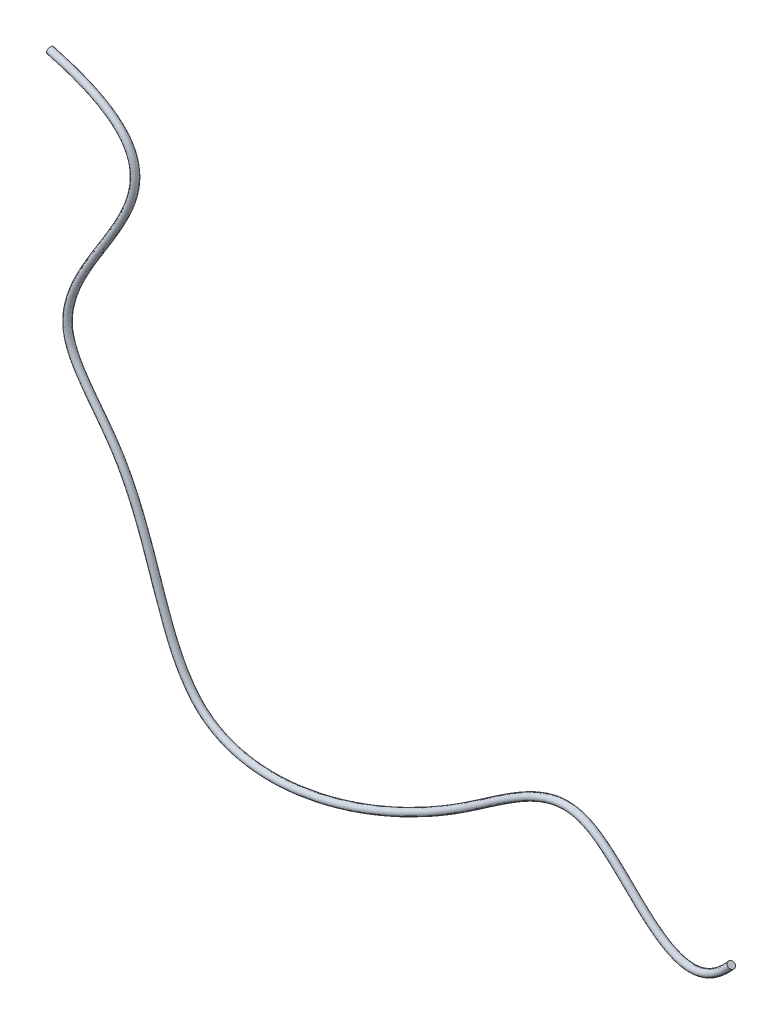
ISO-10303-21;
HEADER;
FILE_DESCRIPTION(('STEP AP214'),'2;1');
FILE_NAME('part.step','',(''),(''),'','','');
FILE_SCHEMA(('AUTOMOTIVE_DESIGN { 1 0 10303 214 1 1 1 1 }'));
ENDSEC;
DATA;
#1=APPLICATION_CONTEXT('core data for automotive mechanical design processes');
#2=APPLICATION_PROTOCOL_DEFINITION('international standard','automotive_design',2000,#1);
#3=PRODUCT_CONTEXT('',#1,'mechanical');
#4=PRODUCT('Part','Part','',(#3));
#5=PRODUCT_RELATED_PRODUCT_CATEGORY('part','',(#4));
#6=PRODUCT_DEFINITION_FORMATION('','',#4);
#7=PRODUCT_DEFINITION_CONTEXT('part definition',#1,'design');
#8=PRODUCT_DEFINITION('design','',#6,#7);
#9=PRODUCT_DEFINITION_SHAPE('','',#8);
#10=(LENGTH_UNIT() NAMED_UNIT(*) SI_UNIT(.MILLI.,.METRE.));
#11=(NAMED_UNIT(*) PLANE_ANGLE_UNIT() SI_UNIT($,.RADIAN.));
#12=(NAMED_UNIT(*) SI_UNIT($,.STERADIAN.) SOLID_ANGLE_UNIT());
#13=UNCERTAINTY_MEASURE_WITH_UNIT(LENGTH_MEASURE(1.E-05),#10,'distance_accuracy_value','');
#14=(GEOMETRIC_REPRESENTATION_CONTEXT(3) GLOBAL_UNCERTAINTY_ASSIGNED_CONTEXT((#13)) GLOBAL_UNIT_ASSIGNED_CONTEXT((#10,
#11,#12)) REPRESENTATION_CONTEXT('',''));
#15=CARTESIAN_POINT('',(0.,0.,0.));
#16=DIRECTION('',(0.,0.,1.));
#17=DIRECTION('',(1.,0.,0.));
#18=AXIS2_PLACEMENT_3D('',#15,#16,#17);
#19=CARTESIAN_POINT('',(0.,663.031643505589,0.));
#20=DIRECTION('',(0.967090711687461,-0.254431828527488,-3.80531743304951E-13));
#21=DIRECTION('',(0.254431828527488,0.967090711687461,0.));
#22=AXIS2_PLACEMENT_3D('',#19,#20,#21);
#23=PLANE('',#22);
#24=CARTESIAN_POINT('',(0.,663.031643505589,0.));
#25=DIRECTION('',(0.967090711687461,-0.254431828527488,-3.80531743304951E-13));
#26=DIRECTION('',(0.254431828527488,0.967090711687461,0.));
#27=AXIS2_PLACEMENT_3D('',#24,#25,#26);
#28=CIRCLE('',#27,5.);
#29=CARTESIAN_POINT('',(1.27215914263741,667.867097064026,0.));
#30=VERTEX_POINT('',#29);
#31=EDGE_CURVE('E43',#30,#30,#28,.T.);
#32=ORIENTED_EDGE('',*,*,#31,.F.);
#33=EDGE_LOOP('',(#32));
#34=FACE_BOUND('',#33,.T.);
#35=ADVANCED_FACE('F37',(#34),#23,.F.);
#36=CARTESIAN_POINT('',(1000.,0.,0.));
#37=DIRECTION('',(0.652907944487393,0.757437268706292,6.94930177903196E-13));
#38=DIRECTION('',(-0.757437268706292,0.652907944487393,3.48567825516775E-13));
#39=AXIS2_PLACEMENT_3D('',#36,#37,#38);
#40=PLANE('',#39);
#41=CARTESIAN_POINT('',(1000.,0.,0.));
#42=DIRECTION('',(0.652907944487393,0.757437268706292,6.94930177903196E-13));
#43=DIRECTION('',(-0.757437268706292,0.652907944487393,3.48567825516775E-13));
#44=AXIS2_PLACEMENT_3D('',#41,#42,#43);
#45=CIRCLE('',#44,5.);
#46=CARTESIAN_POINT('',(996.212813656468,3.26453972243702,1.7428391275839E-12));
#47=VERTEX_POINT('',#46);
#48=EDGE_CURVE('E11',#47,#47,#45,.T.);
#49=ORIENTED_EDGE('',*,*,#48,.T.);
#50=EDGE_LOOP('',(#49));
#51=FACE_BOUND('',#50,.T.);
#52=ADVANCED_FACE('F52',(#51),#40,.T.);
#53=CARTESIAN_POINT('',(1.27215914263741,667.867097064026,0.));
#54=CARTESIAN_POINT('',(35.9701092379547,658.738415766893,-1.36529813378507E-11));
#55=CARTESIAN_POINT('',(62.2858632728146,648.283380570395,-2.43094363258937E-11));
#56=CARTESIAN_POINT('',(91.6965273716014,630.690836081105,-3.67747192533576E-11));
#57=CARTESIAN_POINT('',(99.8232418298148,624.502564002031,-4.03438579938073E-11));
#58=CARTESIAN_POINT('',(113.061953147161,611.469189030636,-4.64451937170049E-11));
#59=CARTESIAN_POINT('',(118.171034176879,604.618135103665,-4.89768173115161E-11));
#60=CARTESIAN_POINT('',(125.620048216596,590.364437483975,-5.30937130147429E-11));
#61=CARTESIAN_POINT('',(127.951714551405,582.968773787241,-5.46753218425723E-11));
#62=CARTESIAN_POINT('',(130.203206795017,567.901427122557,-5.70096823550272E-11));
#63=CARTESIAN_POINT('',(130.129752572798,560.235808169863,-5.77644090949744E-11));
#64=CARTESIAN_POINT('',(127.084596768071,537.05229668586,-5.90727841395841E-11));
#65=CARTESIAN_POINT('',(121.326142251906,521.337025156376,-5.86856565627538E-11));
#66=CARTESIAN_POINT('',(105.978175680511,489.533765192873,-5.67930527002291E-11));
#67=CARTESIAN_POINT('',(96.3644450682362,473.434715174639,-5.52795361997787E-11));
#68=CARTESIAN_POINT('',(76.5204692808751,441.16156594,-5.23691242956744E-11));
#69=CARTESIAN_POINT('',(66.2882433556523,424.989335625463,-5.09713343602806E-11));
#70=CARTESIAN_POINT('',(48.4457706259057,393.085759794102,-4.95175846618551E-11));
#71=CARTESIAN_POINT('',(40.8457504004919,377.353528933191,-4.94654946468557E-11));
#72=CARTESIAN_POINT('',(33.7664898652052,354.620920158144,-5.12723134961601E-11));
#73=CARTESIAN_POINT('',(32.1247808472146,347.191058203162,-5.21876831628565E-11));
#74=CARTESIAN_POINT('',(30.6118782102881,332.702898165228,-5.47706522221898E-11));
#75=CARTESIAN_POINT('',(30.737517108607,325.647693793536,-5.64368121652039E-11));
#76=CARTESIAN_POINT('',(33.4169931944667,309.845429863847,-6.12719403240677E-11));
#77=CARTESIAN_POINT('',(36.7245422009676,301.001764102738,-6.4774988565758E-11));
#78=CARTESIAN_POINT('',(45.9340586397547,283.160334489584,-7.29502711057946E-11));
#79=CARTESIAN_POINT('',(51.8313033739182,274.17801317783,-7.76194339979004E-11));
#80=CARTESIAN_POINT('',(71.5744979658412,246.734470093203,-9.2668933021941E-11));
#81=CARTESIAN_POINT('',(87.4659821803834,227.808388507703,-1.04086371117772E-10));
#82=CARTESIAN_POINT('',(116.095874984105,183.54094334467,-1.27164640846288E-10));
#83=CARTESIAN_POINT('',(127.877236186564,158.133347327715,-1.38523334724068E-10));
#84=CARTESIAN_POINT('',(148.158416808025,106.700506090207,-1.58026969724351E-10));
#85=CARTESIAN_POINT('',(156.659920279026,80.6678346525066,-1.66173170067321E-10));
#86=CARTESIAN_POINT('',(173.713185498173,31.29197647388,-1.77701756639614E-10));
#87=CARTESIAN_POINT('',(182.271135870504,7.95028759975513,-1.81086310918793E-10));
#88=CARTESIAN_POINT('',(197.491090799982,-22.5004276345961,-1.81365283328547E-10));
#89=CARTESIAN_POINT('',(202.958726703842,-31.8889106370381,-1.80657448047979E-10));
#90=CARTESIAN_POINT('',(215.035190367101,-48.7455205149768,-1.77424067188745E-10));
#91=CARTESIAN_POINT('',(221.640644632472,-56.2120196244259,-1.74897130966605E-10));
#92=CARTESIAN_POINT('',(238.370487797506,-70.6395645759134,-1.66855177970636E-10));
#93=CARTESIAN_POINT('',(249.057560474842,-76.9931503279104,-1.60754961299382E-10));
#94=CARTESIAN_POINT('',(272.753526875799,-86.5595233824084,-1.4635050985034E-10));
#95=CARTESIAN_POINT('',(285.763173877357,-89.7661369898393,-1.38046027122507E-10));
#96=CARTESIAN_POINT('',(327.628648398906,-95.0013642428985,-1.11230235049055E-10));
#97=CARTESIAN_POINT('',(359.313918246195,-92.6235708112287,-9.08120891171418E-11));
#98=CARTESIAN_POINT('',(426.219011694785,-78.3535181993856,-5.22100931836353E-11));
#99=CARTESIAN_POINT('',(461.432635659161,-66.4750086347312,-3.4025117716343E-11));
#100=CARTESIAN_POINT('',(531.433997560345,-35.7322467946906,-7.25228688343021E-12));
#101=CARTESIAN_POINT('',(566.224085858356,-16.8702441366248,1.33450430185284E-12));
#102=CARTESIAN_POINT('',(615.482296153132,14.9291795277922,1.4693492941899E-12));
#103=CARTESIAN_POINT('',(631.615745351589,26.2789965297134,-7.10711860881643E-13));
#104=CARTESIAN_POINT('',(663.047014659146,47.7586575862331,-7.99968517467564E-12));
#105=CARTESIAN_POINT('',(678.341996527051,57.8903223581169,-1.31073887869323E-11));
#106=CARTESIAN_POINT('',(708.352089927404,74.45432515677,-2.47756585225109E-11));
#107=CARTESIAN_POINT('',(723.074916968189,80.9041905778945,-3.13375897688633E-11));
#108=CARTESIAN_POINT('',(745.03160240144,85.7619471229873,-4.12216402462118E-11));
#109=CARTESIAN_POINT('',(752.331177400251,86.5720482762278,-4.45244411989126E-11));
#110=CARTESIAN_POINT('',(766.861741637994,86.1756403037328,-5.09463596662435E-11));
#111=CARTESIAN_POINT('',(774.090359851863,84.9641679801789,-5.40650215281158E-11));
#112=CARTESIAN_POINT('',(790.856466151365,79.3482172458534,-6.08983861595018E-11));
#113=CARTESIAN_POINT('',(800.114780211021,74.0601433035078,-6.43549201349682E-11));
#114=CARTESIAN_POINT('',(818.20677072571,61.0945618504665,-7.01065510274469E-11));
#115=CARTESIAN_POINT('',(827.04846764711,53.4027002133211,-7.24058498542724E-11));
#116=CARTESIAN_POINT('',(844.57517607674,37.0894541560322,-7.56231897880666E-11));
#117=CARTESIAN_POINT('',(853.258194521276,28.4656291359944,-7.65406999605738E-11));
#118=CARTESIAN_POINT('',(870.602332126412,11.7646455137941,-7.6723845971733E-11));
#119=CARTESIAN_POINT('',(879.2642039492,3.68838676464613,-7.59896841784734E-11));
#120=CARTESIAN_POINT('',(896.612897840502,-10.4242576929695,-7.25647909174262E-11));
#121=CARTESIAN_POINT('',(905.29941093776,-16.4527132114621,-6.98732673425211E-11));
#122=CARTESIAN_POINT('',(922.619669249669,-25.0655695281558,-6.21903453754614E-11));
#123=CARTESIAN_POINT('',(931.217080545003,-27.6491203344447,-5.71853943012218E-11));
#124=CARTESIAN_POINT('',(944.210488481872,-28.1770197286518,-4.77926544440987E-11));
#125=CARTESIAN_POINT('',(948.568037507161,-27.7987865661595,-4.43516222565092E-11));
#126=CARTESIAN_POINT('',(957.457594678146,-25.7527965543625,-3.6854659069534E-11));
#127=CARTESIAN_POINT('',(961.992869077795,-24.0831006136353,-3.27997742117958E-11));
#128=CARTESIAN_POINT('',(975.989673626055,-16.7569165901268,-1.96915650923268E-11));
#129=CARTESIAN_POINT('',(985.851366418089,-8.75575557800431,-9.69573669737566E-12));
#130=CARTESIAN_POINT('',(996.212813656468,3.26453972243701,1.7428391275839E-12));
#131=CARTESIAN_POINT('',(1.27215914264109,667.867097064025,10.));
#132=CARTESIAN_POINT('',(35.9701092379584,658.738415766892,9.99999999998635));
#133=CARTESIAN_POINT('',(62.2858632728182,648.28338057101,9.99999999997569));
#134=CARTESIAN_POINT('',(91.696527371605,630.690836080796,9.99999999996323));
#135=CARTESIAN_POINT('',(99.8232418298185,624.502564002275,9.99999999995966));
#136=CARTESIAN_POINT('',(113.061953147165,611.46918903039,9.99999999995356));
#137=CARTESIAN_POINT('',(118.171034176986,604.618135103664,9.99999999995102));
#138=CARTESIAN_POINT('',(125.620048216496,590.364437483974,9.9999999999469));
#139=CARTESIAN_POINT('',(127.951714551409,582.96877378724,9.99999999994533));
#140=CARTESIAN_POINT('',(130.20320679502,567.901427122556,9.99999999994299));
#141=CARTESIAN_POINT('',(130.129752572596,560.235808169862,9.99999999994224));
#142=CARTESIAN_POINT('',(127.084596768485,537.052296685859,9.99999999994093));
#143=CARTESIAN_POINT('',(121.326142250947,521.337025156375,9.99999999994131));
#144=CARTESIAN_POINT('',(105.978175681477,489.533765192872,9.99999999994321));
#145=CARTESIAN_POINT('',(96.364445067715,473.434715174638,9.99999999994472));
#146=CARTESIAN_POINT('',(76.520469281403,441.161565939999,9.99999999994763));
#147=CARTESIAN_POINT('',(66.2882433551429,424.989335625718,9.99999999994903));
#148=CARTESIAN_POINT('',(48.4457706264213,393.085759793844,9.99999999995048));
#149=CARTESIAN_POINT('',(40.8457504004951,377.353528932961,9.99999999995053));
#150=CARTESIAN_POINT('',(33.7664898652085,354.620920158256,9.99999999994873));
#151=CARTESIAN_POINT('',(32.124780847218,347.19105820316,9.99999999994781));
#152=CARTESIAN_POINT('',(30.6118782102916,332.702898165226,9.99999999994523));
#153=CARTESIAN_POINT('',(30.7375171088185,325.647693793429,9.99999999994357));
#154=CARTESIAN_POINT('',(33.4169931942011,309.845429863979,9.99999999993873));
#155=CARTESIAN_POINT('',(36.7245422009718,301.001764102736,9.99999999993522));
#156=CARTESIAN_POINT('',(45.934058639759,283.160334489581,9.99999999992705));
#157=CARTESIAN_POINT('',(51.8313033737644,274.178013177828,9.99999999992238));
#158=CARTESIAN_POINT('',(71.5744979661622,246.7344700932,9.99999999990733));
#159=CARTESIAN_POINT('',(87.4659821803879,227.808388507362,9.99999999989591));
#160=CARTESIAN_POINT('',(116.09587498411,183.540943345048,9.99999999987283));
#161=CARTESIAN_POINT('',(127.877236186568,158.133347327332,9.99999999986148));
#162=CARTESIAN_POINT('',(148.15841680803,106.700506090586,9.99999999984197));
#163=CARTESIAN_POINT('',(156.659920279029,80.6678346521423,9.99999999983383));
#164=CARTESIAN_POINT('',(173.713185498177,31.2919764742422,9.9999999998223));
#165=CARTESIAN_POINT('',(182.271135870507,7.95028759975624,9.99999999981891));
#166=CARTESIAN_POINT('',(197.491090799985,-22.500427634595,9.99999999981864));
#167=CARTESIAN_POINT('',(202.958726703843,-31.8889106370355,9.99999999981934));
#168=CARTESIAN_POINT('',(215.035190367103,-48.7455205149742,9.99999999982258));
#169=CARTESIAN_POINT('',(221.64064463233,-56.2120196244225,9.9999999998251));
#170=CARTESIAN_POINT('',(238.370487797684,-70.6395645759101,9.99999999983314));
#171=CARTESIAN_POINT('',(249.057560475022,-76.9931503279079,9.99999999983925));
#172=CARTESIAN_POINT('',(272.75352687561,-86.5595233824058,9.99999999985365));
#173=CARTESIAN_POINT('',(285.763173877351,-89.7661369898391,9.99999999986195));
#174=CARTESIAN_POINT('',(327.6286483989,-95.0013642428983,9.99999999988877));
#175=CARTESIAN_POINT('',(359.31391824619,-92.6235708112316,9.99999999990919));
#176=CARTESIAN_POINT('',(426.21901169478,-78.3535181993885,9.99999999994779));
#177=CARTESIAN_POINT('',(461.432635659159,-66.4750086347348,9.99999999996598));
#178=CARTESIAN_POINT('',(531.433997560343,-35.7322467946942,9.99999999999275));
#179=CARTESIAN_POINT('',(566.224085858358,-16.8702441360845,10.0000000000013));
#180=CARTESIAN_POINT('',(615.482296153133,14.9291795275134,10.0000000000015));
#181=CARTESIAN_POINT('',(631.615745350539,26.278996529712,9.99999999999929));
#182=CARTESIAN_POINT('',(663.047014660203,47.7586575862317,9.999999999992));
#183=CARTESIAN_POINT('',(678.341996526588,57.8903223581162,9.99999999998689));
#184=CARTESIAN_POINT('',(708.352089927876,74.4543251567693,9.99999999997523));
#185=CARTESIAN_POINT('',(723.074916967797,80.9041905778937,9.99999999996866));
#186=CARTESIAN_POINT('',(745.031602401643,85.7619471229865,9.99999999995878));
#187=CARTESIAN_POINT('',(752.331177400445,86.5720482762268,9.99999999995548));
#188=CARTESIAN_POINT('',(766.86174163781,86.1756403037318,9.99999999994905));
#189=CARTESIAN_POINT('',(774.090359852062,84.9641679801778,9.99999999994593));
#190=CARTESIAN_POINT('',(790.856466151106,79.3482172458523,9.9999999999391));
#191=CARTESIAN_POINT('',(800.114780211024,74.0601433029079,9.99999999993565));
#192=CARTESIAN_POINT('',(818.206770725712,61.0945618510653,9.99999999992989));
#193=CARTESIAN_POINT('',(827.048467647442,53.4027002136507,9.99999999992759));
#194=CARTESIAN_POINT('',(844.575176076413,37.0894541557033,9.99999999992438));
#195=CARTESIAN_POINT('',(853.258194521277,28.4656291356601,9.99999999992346));
#196=CARTESIAN_POINT('',(870.602332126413,11.764645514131,9.99999999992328));
#197=CARTESIAN_POINT('',(879.264203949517,3.6883867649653,9.99999999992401));
#198=CARTESIAN_POINT('',(896.612897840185,-10.4242576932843,9.99999999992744));
#199=CARTESIAN_POINT('',(905.299410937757,-16.4527132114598,9.99999999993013));
#200=CARTESIAN_POINT('',(922.619669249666,-25.0655695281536,9.99999999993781));
#201=CARTESIAN_POINT('',(931.217080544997,-27.6491203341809,9.99999999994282));
#202=CARTESIAN_POINT('',(944.210488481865,-28.1770197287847,9.99999999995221));
#203=CARTESIAN_POINT('',(948.568037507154,-27.7987865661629,9.99999999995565));
#204=CARTESIAN_POINT('',(957.45759467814,-25.7527965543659,9.99999999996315));
#205=CARTESIAN_POINT('',(961.99286907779,-24.0831006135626,9.9999999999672));
#206=CARTESIAN_POINT('',(975.98967362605,-16.7569165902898,9.99999999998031));
#207=CARTESIAN_POINT('',(985.851366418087,-8.75575557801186,9.9999999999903));
#208=CARTESIAN_POINT('',(996.212813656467,3.26453972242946,10.0000000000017));
#209=CARTESIAN_POINT('',(-1.27215914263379,658.196189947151,10.));
#210=CARTESIAN_POINT('',(32.8087585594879,649.229843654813,9.99999999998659));
#211=CARTESIAN_POINT('',(58.2945709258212,639.018354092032,9.99999999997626));
#212=CARTESIAN_POINT('',(85.9920761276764,622.450567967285,9.99999999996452));
#213=CARTESIAN_POINT('',(93.4690547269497,616.725305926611,9.99999999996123));
#214=CARTESIAN_POINT('',(105.384964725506,604.994215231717,9.99999999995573));
#215=CARTESIAN_POINT('',(109.826811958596,598.994337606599,9.99999999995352));
#216=CARTESIAN_POINT('',(116.238851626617,586.724891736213,9.99999999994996));
#217=CARTESIAN_POINT('',(118.217310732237,580.44834349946,9.9999999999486));
#218=CARTESIAN_POINT('',(120.157228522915,567.466102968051,9.99999999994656));
#219=CARTESIAN_POINT('',(120.11196733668,560.754346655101,9.99999999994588));
#220=CARTESIAN_POINT('',(117.375658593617,539.922162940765,9.99999999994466));
#221=CARTESIAN_POINT('',(112.046045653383,525.11554511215,9.99999999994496));
#222=CARTESIAN_POINT('',(97.2460575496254,494.447777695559,9.99999999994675));
#223=CARTESIAN_POINT('',(87.7999009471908,478.597689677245,9.99999999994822));
#224=CARTESIAN_POINT('',(68.047978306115,446.474250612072,9.99999999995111));
#225=CARTESIAN_POINT('',(57.7441930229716,430.199030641,9.99999999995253));
#226=CARTESIAN_POINT('',(39.5342150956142,397.638330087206,9.99999999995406));
#227=CARTESIAN_POINT('',(31.617795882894,381.353734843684,9.99999999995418));
#228=CARTESIAN_POINT('',(24.0588478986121,357.080774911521,9.99999999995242));
#229=CARTESIAN_POINT('',(22.2605625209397,349.012059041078,9.99999999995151));
#230=CARTESIAN_POINT('',(20.5842552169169,332.959070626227,9.99999999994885));
#231=CARTESIAN_POINT('',(20.7094007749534,324.971704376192,9.99999999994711));
#232=CARTESIAN_POINT('',(23.7766698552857,306.882423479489,9.99999999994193));
#233=CARTESIAN_POINT('',(27.4993424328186,297.07206027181,9.99999999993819));
#234=CARTESIAN_POINT('',(37.3872661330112,277.916364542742,9.99999999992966));
#235=CARTESIAN_POINT('',(43.5572399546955,268.555589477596,9.99999999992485));
#236=CARTESIAN_POINT('',(63.7697980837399,240.459619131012,9.99999999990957));
#237=CARTESIAN_POINT('',(79.5209450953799,221.679059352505,9.99999999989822));
#238=CARTESIAN_POINT('',(107.191257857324,178.89531366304,9.99999999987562));
#239=CARTESIAN_POINT('',(118.719944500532,154.095837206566,9.99999999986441));
#240=CARTESIAN_POINT('',(138.709979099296,103.401338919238,9.99999999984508));
#241=CARTESIAN_POINT('',(147.169642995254,77.5137433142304,9.99999999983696));
#242=CARTESIAN_POINT('',(164.299203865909,27.9169794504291,9.99999999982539));
#243=CARTESIAN_POINT('',(172.962912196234,4.20631333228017,9.99999999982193));
#244=CARTESIAN_POINT('',(188.727842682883,-27.334739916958,9.99999999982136));
#245=CARTESIAN_POINT('',(194.447234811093,-37.1790524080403,9.99999999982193));
#246=CARTESIAN_POINT('',(207.288464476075,-55.1031405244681,9.99999999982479));
#247=CARTESIAN_POINT('',(214.413675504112,-63.1845439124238,9.99999999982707));
#248=CARTESIAN_POINT('',(232.726115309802,-78.9768944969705,9.99999999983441));
#249=CARTESIAN_POINT('',(244.396941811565,-85.8957723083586,9.9999999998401));
#250=CARTESIAN_POINT('',(269.927005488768,-96.2025945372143,9.99999999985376));
#251=CARTESIAN_POINT('',(283.785489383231,-99.5967126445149,9.99999999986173));
#252=CARTESIAN_POINT('',(327.861545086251,-105.108370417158,9.9999999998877));
#253=CARTESIAN_POINT('',(360.58681209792,-102.577007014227,9.99999999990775));
#254=CARTESIAN_POINT('',(429.118038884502,-87.960119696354,9.99999999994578));
#255=CARTESIAN_POINT('',(464.930198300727,-75.8608461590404,9.99999999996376));
#256=CARTESIAN_POINT('',(535.978529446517,-44.6582828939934,9.99999999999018));
#257=CARTESIAN_POINT('',(571.212350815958,-25.5527435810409,9.99999999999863));
#258=CARTESIAN_POINT('',(621.12765523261,6.67087768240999,9.99999999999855));
#259=CARTESIAN_POINT('',(637.336100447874,18.0761617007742,9.99999999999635));
#260=CARTESIAN_POINT('',(668.611052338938,39.4489977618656,9.99999999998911));
#261=CARTESIAN_POINT('',(683.680397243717,49.4147290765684,9.99999999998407));
#262=CARTESIAN_POINT('',(712.678237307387,65.4200209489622,9.99999999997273));
#263=CARTESIAN_POINT('',(726.599016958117,71.4420541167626,9.99999999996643));
#264=CARTESIAN_POINT('',(746.509837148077,75.8471778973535,9.99999999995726));
#265=CARTESIAN_POINT('',(752.983113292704,76.5505422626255,9.99999999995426));
#266=CARTESIAN_POINT('',(765.66438915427,76.2045846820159,9.99999999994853));
#267=CARTESIAN_POINT('',(771.874759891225,75.1602259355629,9.9999999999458));
#268=CARTESIAN_POINT('',(786.380360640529,70.3014508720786,9.99999999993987));
#269=CARTESIAN_POINT('',(794.829296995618,65.5451928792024,9.99999999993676));
#270=CARTESIAN_POINT('',(811.842079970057,53.353022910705,9.99999999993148));
#271=CARTESIAN_POINT('',(820.397906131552,45.9314650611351,9.9999999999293));
#272=CARTESIAN_POINT('',(837.599480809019,29.9208421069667,9.99999999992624));
#273=CARTESIAN_POINT('',(846.247222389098,21.3342176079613,9.99999999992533));
#274=CARTESIAN_POINT('',(863.740806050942,4.48932967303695,9.99999999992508));
#275=CARTESIAN_POINT('',(872.585895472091,-3.76983361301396,9.99999999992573));
#276=CARTESIAN_POINT('',(890.670289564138,-18.4809482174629,9.99999999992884));
#277=CARTESIAN_POINT('',(899.909903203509,-24.9408297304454,9.99999999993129));
#278=CARTESIAN_POINT('',(919.104028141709,-34.4855049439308,9.99999999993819));
#279=CARTESIAN_POINT('',(929.094873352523,-37.5711486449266,9.99999999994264));
#280=CARTESIAN_POINT('',(944.662670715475,-38.2036409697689,9.99999999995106));
#281=CARTESIAN_POINT('',(949.938660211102,-37.7447713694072,9.99999999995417));
#282=CARTESIAN_POINT('',(960.572824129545,-35.2972486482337,9.99999999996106));
#283=CARTESIAN_POINT('',(965.927732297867,-33.3105346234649,9.99999999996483));
#284=CARTESIAN_POINT('',(982.03199732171,-24.8812671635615,9.99999999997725));
#285=CARTESIAN_POINT('',(992.811713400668,-15.9971650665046,9.99999999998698));
#286=CARTESIAN_POINT('',(1003.78718634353,-3.26453972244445,9.99999999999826));
#287=CARTESIAN_POINT('',(-1.27215914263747,658.196189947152,0.));
#288=CARTESIAN_POINT('',(32.8087585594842,649.229843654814,-1.34095785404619E-11));
#289=CARTESIAN_POINT('',(58.2945709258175,639.018354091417,-2.37373147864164E-11));
#290=CARTESIAN_POINT('',(85.9920761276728,622.450567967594,-3.54794616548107E-11));
#291=CARTESIAN_POINT('',(93.4690547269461,616.725305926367,-3.8767990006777E-11));
#292=CARTESIAN_POINT('',(105.384964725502,604.994215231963,-4.42673051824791E-11));
#293=CARTESIAN_POINT('',(109.826811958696,598.9943376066,-4.6478665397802E-11));
#294=CARTESIAN_POINT('',(116.23885162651,586.724891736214,-5.00413231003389E-11));
#295=CARTESIAN_POINT('',(118.217310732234,580.448343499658,-5.13962838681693E-11));
#296=CARTESIAN_POINT('',(120.157228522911,567.466102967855,-5.34369174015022E-11));
#297=CARTESIAN_POINT('',(120.111967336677,560.754346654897,-5.41206151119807E-11));
#298=CARTESIAN_POINT('',(117.375658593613,539.922162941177,-5.53426993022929E-11));
#299=CARTESIAN_POINT('',(112.04604565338,525.115545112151,-5.50370475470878E-11));
#300=CARTESIAN_POINT('',(97.246057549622,494.44777769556,-5.32507409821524E-11));
#301=CARTESIAN_POINT('',(87.7999009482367,478.597689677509,-5.1778126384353E-11));
#302=CARTESIAN_POINT('',(68.0479783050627,446.474250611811,-4.88890768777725E-11));
#303=CARTESIAN_POINT('',(57.7441930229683,430.199030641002,-4.74735364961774E-11));
#304=CARTESIAN_POINT('',(39.5342150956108,397.638330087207,-4.59395788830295E-11));
#305=CARTESIAN_POINT('',(31.6177958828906,381.353734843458,-4.58172919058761E-11));
#306=CARTESIAN_POINT('',(24.0588478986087,357.080774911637,-4.75777369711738E-11));
#307=CARTESIAN_POINT('',(22.2605625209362,349.012059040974,-4.84895935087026E-11));
#308=CARTESIAN_POINT('',(20.5842552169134,332.959070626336,-5.11456223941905E-11));
#309=CARTESIAN_POINT('',(20.7094007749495,324.971704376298,-5.28912341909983E-11));
#310=CARTESIAN_POINT('',(23.7766698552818,306.882423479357,-5.80656161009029E-11));
#311=CARTESIAN_POINT('',(27.4993424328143,297.072060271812,-6.18052625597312E-11));
#312=CARTESIAN_POINT('',(37.3872661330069,277.916364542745,-7.03445158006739E-11));
#313=CARTESIAN_POINT('',(43.5572399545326,268.555589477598,-7.51471939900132E-11));
#314=CARTESIAN_POINT('',(63.7697980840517,240.459619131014,-9.04265663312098E-11));
#315=CARTESIAN_POINT('',(79.5209450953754,221.679059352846,-1.01779506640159E-10));
#316=CARTESIAN_POINT('',(107.19125785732,178.895313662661,-1.24375014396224E-10));
#317=CARTESIAN_POINT('',(118.719944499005,154.095837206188,-1.3558801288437E-10));
#318=CARTESIAN_POINT('',(138.709979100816,103.401338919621,-1.54920554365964E-10));
#319=CARTESIAN_POINT('',(147.169642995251,77.5137433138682,-1.6303883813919E-10));
#320=CARTESIAN_POINT('',(164.299203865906,27.9169794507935,-1.74614602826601E-10));
#321=CARTESIAN_POINT('',(172.962912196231,4.20631333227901,-1.78069915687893E-10));
#322=CARTESIAN_POINT('',(188.727842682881,-27.3347399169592,-1.78644224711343E-10));
#323=CARTESIAN_POINT('',(194.447234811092,-37.1790524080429,-1.78068733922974E-10));
#324=CARTESIAN_POINT('',(207.288464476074,-55.1031405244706,-1.75210280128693E-10));
#325=CARTESIAN_POINT('',(214.413675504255,-63.1845439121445,-1.72928707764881E-10));
#326=CARTESIAN_POINT('',(232.726115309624,-78.9768944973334,-1.65590501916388E-10));
#327=CARTESIAN_POINT('',(244.396941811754,-85.8957723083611,-1.59903555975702E-10));
#328=CARTESIAN_POINT('',(269.927005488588,-96.2025945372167,-1.46242820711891E-10));
#329=CARTESIAN_POINT('',(283.785489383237,-99.5967126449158,-1.38269279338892E-10));
#330=CARTESIAN_POINT('',(327.861545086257,-105.108370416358,-1.12297239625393E-10));
#331=CARTESIAN_POINT('',(360.586812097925,-102.577007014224,-9.22518183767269E-11));
#332=CARTESIAN_POINT('',(429.118038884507,-87.9601196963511,-5.42234959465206E-11));
#333=CARTESIAN_POINT('',(464.93019829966,-75.8608461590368,-3.6241720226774E-11));
#334=CARTESIAN_POINT('',(535.978529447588,-44.6582828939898,-9.8180393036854E-12));
#335=CARTESIAN_POINT('',(571.212350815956,-25.5527435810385,-1.3750699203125E-12));
#336=CARTESIAN_POINT('',(621.127655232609,6.67087768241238,-1.44777084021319E-12));
#337=CARTESIAN_POINT('',(637.33610044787,18.0761617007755,-3.65091733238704E-12));
#338=CARTESIAN_POINT('',(668.611052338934,39.4489977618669,-1.08910221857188E-11));
#339=CARTESIAN_POINT('',(683.680397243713,49.4147290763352,-1.59291890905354E-11));
#340=CARTESIAN_POINT('',(712.678237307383,65.4200209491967,-2.7269638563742E-11));
#341=CARTESIAN_POINT('',(726.599016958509,71.4420541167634,-3.35705560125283E-11));
#342=CARTESIAN_POINT('',(746.509837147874,75.8471778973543,-4.27342486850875E-11));
#343=CARTESIAN_POINT('',(752.983113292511,76.5505422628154,-4.57396071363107E-11));
#344=CARTESIAN_POINT('',(765.664389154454,76.204584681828,-5.14711202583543E-11));
#345=CARTESIAN_POINT('',(771.874759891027,75.1602259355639,-5.41977305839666E-11));
#346=CARTESIAN_POINT('',(786.380360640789,70.3014508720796,-6.01277504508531E-11));
#347=CARTESIAN_POINT('',(794.829296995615,65.5451928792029,-6.32385679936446E-11));
#348=CARTESIAN_POINT('',(811.842079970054,53.3530229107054,-6.85237346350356E-11));
#349=CARTESIAN_POINT('',(820.39790613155,45.9314650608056,-7.06938818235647E-11));
#350=CARTESIAN_POINT('',(837.599480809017,29.9208421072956,-7.37647423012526E-11));
#351=CARTESIAN_POINT('',(846.247222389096,21.3342176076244,-7.4665986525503E-11));
#352=CARTESIAN_POINT('',(863.740806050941,4.4893296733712,-7.49168715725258E-11));
#353=CARTESIAN_POINT('',(872.585895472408,-3.76983361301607,-7.42663100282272E-11));
#354=CARTESIAN_POINT('',(890.670289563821,-18.4809482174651,-7.11654927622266E-11));
#355=CARTESIAN_POINT('',(899.909903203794,-24.9408297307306,-6.8716029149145E-11));
#356=CARTESIAN_POINT('',(919.104028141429,-34.48550494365,-6.18079267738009E-11));
#357=CARTESIAN_POINT('',(929.094873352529,-37.5711486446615,-5.73628406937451E-11));
#358=CARTESIAN_POINT('',(944.662670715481,-38.2036409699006,-4.89341477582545E-11));
#359=CARTESIAN_POINT('',(949.938660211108,-37.7447713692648,-4.58269728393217E-11));
#360=CARTESIAN_POINT('',(960.572824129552,-35.2972486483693,-3.89429645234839E-11));
#361=CARTESIAN_POINT('',(965.927732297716,-33.3105346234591,-3.51650849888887E-11));
#362=CARTESIAN_POINT('',(982.03199732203,-24.8812671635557,-2.27445176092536E-11));
#363=CARTESIAN_POINT('',(992.811713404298,-15.9971650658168,-1.30138505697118E-11));
#364=CARTESIAN_POINT('',(1003.78718634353,-3.2645397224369,-1.74222680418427E-12));
#365=CARTESIAN_POINT('',(-1.27215914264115,658.196189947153,-10.));
#366=CARTESIAN_POINT('',(32.8087585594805,649.229843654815,-10.0000000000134));
#367=CARTESIAN_POINT('',(58.2945709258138,639.018354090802,-10.0000000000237));
#368=CARTESIAN_POINT('',(85.9920761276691,622.450567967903,-10.0000000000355));
#369=CARTESIAN_POINT('',(93.4690547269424,616.725305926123,-10.0000000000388));
#370=CARTESIAN_POINT('',(105.384964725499,604.994215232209,-10.0000000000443));
#371=CARTESIAN_POINT('',(109.826811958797,598.994337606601,-10.0000000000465));
#372=CARTESIAN_POINT('',(116.238851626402,586.724891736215,-10.00000000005));
#373=CARTESIAN_POINT('',(118.21731073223,580.448343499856,-10.0000000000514));
#374=CARTESIAN_POINT('',(120.157228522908,567.46610296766,-10.0000000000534));
#375=CARTESIAN_POINT('',(120.111967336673,560.754346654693,-10.0000000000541));
#376=CARTESIAN_POINT('',(117.37565859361,539.922162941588,-10.0000000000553));
#377=CARTESIAN_POINT('',(112.046045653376,525.115545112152,-10.000000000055));
#378=CARTESIAN_POINT('',(97.2460575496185,494.447777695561,-10.0000000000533));
#379=CARTESIAN_POINT('',(87.7999009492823,478.597689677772,-10.0000000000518));
#380=CARTESIAN_POINT('',(68.0479783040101,446.47425061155,-10.0000000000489));
#381=CARTESIAN_POINT('',(57.7441930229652,430.199030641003,-10.0000000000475));
#382=CARTESIAN_POINT('',(39.5342150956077,397.638330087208,-10.0000000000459));
#383=CARTESIAN_POINT('',(31.6177958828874,381.353734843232,-10.0000000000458));
#384=CARTESIAN_POINT('',(24.0588478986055,357.080774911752,-10.0000000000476));
#385=CARTESIAN_POINT('',(22.2605625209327,349.012059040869,-10.0000000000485));
#386=CARTESIAN_POINT('',(20.5842552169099,332.959070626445,-10.0000000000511));
#387=CARTESIAN_POINT('',(20.7094007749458,324.971704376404,-10.0000000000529));
#388=CARTESIAN_POINT('',(23.776669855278,306.882423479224,-10.0000000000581));
#389=CARTESIAN_POINT('',(27.4993424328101,297.072060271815,-10.0000000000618));
#390=CARTESIAN_POINT('',(37.3872661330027,277.916364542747,-10.0000000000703));
#391=CARTESIAN_POINT('',(43.5572399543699,268.5555894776,-10.0000000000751));
#392=CARTESIAN_POINT('',(63.7697980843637,240.459619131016,-10.0000000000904));
#393=CARTESIAN_POINT('',(79.5209450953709,221.679059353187,-10.0000000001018));
#394=CARTESIAN_POINT('',(107.191257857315,178.895313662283,-10.0000000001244));
#395=CARTESIAN_POINT('',(118.719944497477,154.095837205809,-10.0000000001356));
#396=CARTESIAN_POINT('',(138.709979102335,103.401338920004,-10.0000000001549));
#397=CARTESIAN_POINT('',(147.169642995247,77.513743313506,-10.000000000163));
#398=CARTESIAN_POINT('',(164.299203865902,27.9169794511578,-10.0000000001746));
#399=CARTESIAN_POINT('',(172.962912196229,4.2063133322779,-10.0000000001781));
#400=CARTESIAN_POINT('',(188.727842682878,-27.3347399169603,-10.0000000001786));
#401=CARTESIAN_POINT('',(194.447234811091,-37.1790524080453,-10.0000000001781));
#402=CARTESIAN_POINT('',(207.288464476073,-55.1031405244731,-10.0000000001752));
#403=CARTESIAN_POINT('',(214.413675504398,-63.1845439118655,-10.0000000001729));
#404=CARTESIAN_POINT('',(232.726115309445,-78.9768944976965,-10.0000000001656));
#405=CARTESIAN_POINT('',(244.396941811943,-85.8957723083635,-10.0000000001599));
#406=CARTESIAN_POINT('',(269.927005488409,-96.2025945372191,-10.0000000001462));
#407=CARTESIAN_POINT('',(283.785489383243,-99.5967126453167,-10.0000000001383));
#408=CARTESIAN_POINT('',(327.861545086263,-105.108370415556,-10.0000000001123));
#409=CARTESIAN_POINT('',(360.58681209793,-102.577007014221,-10.0000000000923));
#410=CARTESIAN_POINT('',(429.118038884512,-87.9601196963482,-10.0000000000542));
#411=CARTESIAN_POINT('',(464.930198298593,-75.8608461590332,-10.0000000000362));
#412=CARTESIAN_POINT('',(535.978529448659,-44.6582828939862,-10.0000000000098));
#413=CARTESIAN_POINT('',(571.212350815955,-25.5527435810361,-10.0000000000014));
#414=CARTESIAN_POINT('',(621.127655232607,6.67087768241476,-10.0000000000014));
#415=CARTESIAN_POINT('',(637.336100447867,18.0761617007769,-10.0000000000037));
#416=CARTESIAN_POINT('',(668.611052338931,39.4489977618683,-10.0000000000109));
#417=CARTESIAN_POINT('',(683.680397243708,49.414729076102,-10.0000000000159));
#418=CARTESIAN_POINT('',(712.678237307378,65.4200209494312,-10.0000000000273));
#419=CARTESIAN_POINT('',(726.599016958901,71.4420541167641,-10.0000000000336));
#420=CARTESIAN_POINT('',(746.509837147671,75.847177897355,-10.0000000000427));
#421=CARTESIAN_POINT('',(752.983113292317,76.5505422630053,-10.0000000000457));
#422=CARTESIAN_POINT('',(765.664389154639,76.2045846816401,-10.0000000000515));
#423=CARTESIAN_POINT('',(771.874759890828,75.160225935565,-10.0000000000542));
#424=CARTESIAN_POINT('',(786.380360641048,70.3014508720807,-10.0000000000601));
#425=CARTESIAN_POINT('',(794.829296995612,65.5451928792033,-10.0000000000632));
#426=CARTESIAN_POINT('',(811.842079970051,53.3530229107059,-10.0000000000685));
#427=CARTESIAN_POINT('',(820.397906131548,45.931465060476,-10.0000000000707));
#428=CARTESIAN_POINT('',(837.599480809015,29.9208421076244,-10.0000000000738));
#429=CARTESIAN_POINT('',(846.247222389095,21.3342176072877,-10.0000000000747));
#430=CARTESIAN_POINT('',(863.740806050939,4.48932967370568,-10.0000000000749));
#431=CARTESIAN_POINT('',(872.585895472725,-3.76983361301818,-10.0000000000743));
#432=CARTESIAN_POINT('',(890.670289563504,-18.4809482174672,-10.0000000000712));
#433=CARTESIAN_POINT('',(899.90990320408,-24.9408297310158,-10.0000000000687));
#434=CARTESIAN_POINT('',(919.104028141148,-34.4855049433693,-10.0000000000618));
#435=CARTESIAN_POINT('',(929.094873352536,-37.5711486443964,-10.0000000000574));
#436=CARTESIAN_POINT('',(944.662670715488,-38.2036409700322,-10.0000000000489));
#437=CARTESIAN_POINT('',(949.938660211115,-37.7447713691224,-10.0000000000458));
#438=CARTESIAN_POINT('',(960.572824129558,-35.297248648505,-10.0000000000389));
#439=CARTESIAN_POINT('',(965.927732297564,-33.3105346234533,-10.0000000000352));
#440=CARTESIAN_POINT('',(982.03199732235,-24.8812671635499,-10.0000000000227));
#441=CARTESIAN_POINT('',(992.811713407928,-15.9971650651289,-10.000000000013));
#442=CARTESIAN_POINT('',(1003.78718634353,-3.26453972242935,-10.0000000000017));
#443=CARTESIAN_POINT('',(1.27215914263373,667.867097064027,-10.));
#444=CARTESIAN_POINT('',(35.970109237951,658.738415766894,-10.0000000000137));
#445=CARTESIAN_POINT('',(62.2858632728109,648.28338056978,-10.0000000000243));
#446=CARTESIAN_POINT('',(91.6965273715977,630.690836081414,-10.0000000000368));
#447=CARTESIAN_POINT('',(99.8232418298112,624.502564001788,-10.0000000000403));
#448=CARTESIAN_POINT('',(113.061953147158,611.469189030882,-10.0000000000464));
#449=CARTESIAN_POINT('',(118.171034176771,604.618135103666,-10.000000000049));
#450=CARTESIAN_POINT('',(125.620048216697,590.364437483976,-10.0000000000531));
#451=CARTESIAN_POINT('',(127.951714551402,582.968773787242,-10.0000000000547));
#452=CARTESIAN_POINT('',(130.203206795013,567.901427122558,-10.000000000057));
#453=CARTESIAN_POINT('',(130.129752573,560.235808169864,-10.0000000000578));
#454=CARTESIAN_POINT('',(127.084596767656,537.052296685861,-10.0000000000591));
#455=CARTESIAN_POINT('',(121.326142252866,521.337025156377,-10.0000000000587));
#456=CARTESIAN_POINT('',(105.978175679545,489.533765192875,-10.0000000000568));
#457=CARTESIAN_POINT('',(96.3644450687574,473.43471517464,-10.0000000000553));
#458=CARTESIAN_POINT('',(76.5204692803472,441.161565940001,-10.0000000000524));
#459=CARTESIAN_POINT('',(66.2882433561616,424.989335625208,-10.000000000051));
#460=CARTESIAN_POINT('',(48.4457706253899,393.08575979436,-10.0000000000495));
#461=CARTESIAN_POINT('',(40.8457504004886,377.35352893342,-10.0000000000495));
#462=CARTESIAN_POINT('',(33.7664898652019,354.620920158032,-10.0000000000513));
#463=CARTESIAN_POINT('',(32.1247808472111,347.191058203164,-10.0000000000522));
#464=CARTESIAN_POINT('',(30.6118782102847,332.70289816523,-10.0000000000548));
#465=CARTESIAN_POINT('',(30.7375171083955,325.647693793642,-10.0000000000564));
#466=CARTESIAN_POINT('',(33.4169931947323,309.845429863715,-10.0000000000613));
#467=CARTESIAN_POINT('',(36.7245422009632,301.00176410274,-10.0000000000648));
#468=CARTESIAN_POINT('',(45.9340586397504,283.160334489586,-10.000000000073));
#469=CARTESIAN_POINT('',(51.8313033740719,274.178013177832,-10.0000000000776));
#470=CARTESIAN_POINT('',(71.5744979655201,246.734470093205,-10.0000000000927));
#471=CARTESIAN_POINT('',(87.4659821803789,227.808388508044,-10.0000000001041));
#472=CARTESIAN_POINT('',(116.095874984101,183.540943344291,-10.0000000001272));
#473=CARTESIAN_POINT('',(127.87723618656,158.133347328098,-10.0000000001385));
#474=CARTESIAN_POINT('',(148.158416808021,106.700506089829,-10.000000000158));
#475=CARTESIAN_POINT('',(156.659920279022,80.667834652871,-10.0000000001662));
#476=CARTESIAN_POINT('',(173.71318549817,31.2919764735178,-10.0000000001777));
#477=CARTESIAN_POINT('',(182.271135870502,7.95028759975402,-10.0000000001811));
#478=CARTESIAN_POINT('',(197.49109079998,-22.5004276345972,-10.0000000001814));
#479=CARTESIAN_POINT('',(202.958726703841,-31.8889106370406,-10.0000000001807));
#480=CARTESIAN_POINT('',(215.0351903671,-48.7455205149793,-10.0000000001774));
#481=CARTESIAN_POINT('',(221.640644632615,-56.2120196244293,-10.0000000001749));
#482=CARTESIAN_POINT('',(238.370487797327,-70.6395645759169,-10.0000000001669));
#483=CARTESIAN_POINT('',(249.057560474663,-76.9931503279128,-10.0000000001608));
#484=CARTESIAN_POINT('',(272.753526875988,-86.5595233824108,-10.0000000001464));
#485=CARTESIAN_POINT('',(285.763173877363,-89.7661369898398,-10.000000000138));
#486=CARTESIAN_POINT('',(327.628648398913,-95.0013642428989,-10.0000000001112));
#487=CARTESIAN_POINT('',(359.3139182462,-92.6235708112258,-10.0000000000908));
#488=CARTESIAN_POINT('',(426.21901169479,-78.3535181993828,-10.0000000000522));
#489=CARTESIAN_POINT('',(461.432635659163,-66.4750086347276,-10.000000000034));
#490=CARTESIAN_POINT('',(531.433997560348,-35.732246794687,-10.0000000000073));
#491=CARTESIAN_POINT('',(566.224085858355,-16.8702441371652,-9.99999999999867));
#492=CARTESIAN_POINT('',(615.48229615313,14.9291795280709,-9.99999999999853));
#493=CARTESIAN_POINT('',(631.61574535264,26.2789965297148,-10.0000000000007));
#494=CARTESIAN_POINT('',(663.047014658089,47.7586575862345,-10.000000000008));
#495=CARTESIAN_POINT('',(678.341996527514,57.8903223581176,-10.0000000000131));
#496=CARTESIAN_POINT('',(708.352089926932,74.4543251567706,-10.0000000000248));
#497=CARTESIAN_POINT('',(723.074916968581,80.9041905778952,-10.0000000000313));
#498=CARTESIAN_POINT('',(745.031602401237,85.7619471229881,-10.0000000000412));
#499=CARTESIAN_POINT('',(752.331177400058,86.5720482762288,-10.0000000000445));
#500=CARTESIAN_POINT('',(766.861741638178,86.1756403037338,-10.0000000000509));
#501=CARTESIAN_POINT('',(774.090359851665,84.9641679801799,-10.0000000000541));
#502=CARTESIAN_POINT('',(790.856466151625,79.3482172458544,-10.0000000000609));
#503=CARTESIAN_POINT('',(800.114780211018,74.0601433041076,-10.0000000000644));
#504=CARTESIAN_POINT('',(818.206770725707,61.0945618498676,-10.0000000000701));
#505=CARTESIAN_POINT('',(827.048467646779,53.4027002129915,-10.0000000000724));
#506=CARTESIAN_POINT('',(844.575176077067,37.0894541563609,-10.0000000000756));
#507=CARTESIAN_POINT('',(853.258194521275,28.4656291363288,-10.0000000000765));
#508=CARTESIAN_POINT('',(870.602332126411,11.7646455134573,-10.0000000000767));
#509=CARTESIAN_POINT('',(879.264203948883,3.68838676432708,-10.000000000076));
#510=CARTESIAN_POINT('',(896.612897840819,-10.4242576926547,-10.0000000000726));
#511=CARTESIAN_POINT('',(905.299410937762,-16.4527132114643,-10.0000000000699));
#512=CARTESIAN_POINT('',(922.619669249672,-25.065569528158,-10.0000000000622));
#513=CARTESIAN_POINT('',(931.217080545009,-27.6491203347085,-10.0000000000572));
#514=CARTESIAN_POINT('',(944.210488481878,-28.1770197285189,-10.0000000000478));
#515=CARTESIAN_POINT('',(948.568037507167,-27.7987865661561,-10.0000000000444));
#516=CARTESIAN_POINT('',(957.457594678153,-25.752796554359,-10.0000000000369));
#517=CARTESIAN_POINT('',(961.992869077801,-24.0831006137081,-10.0000000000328));
#518=CARTESIAN_POINT('',(975.98967362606,-16.7569165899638,-10.0000000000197));
#519=CARTESIAN_POINT('',(985.851366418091,-8.75575557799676,-10.0000000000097));
#520=CARTESIAN_POINT('',(996.21281365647,3.26453972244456,-9.99999999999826));
#521=CARTESIAN_POINT('',(1.27215914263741,667.867097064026,0.));
#522=CARTESIAN_POINT('',(35.9701092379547,658.738415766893,-1.36529813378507E-11));
#523=CARTESIAN_POINT('',(62.2858632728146,648.283380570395,-2.43094363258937E-11));
#524=CARTESIAN_POINT('',(91.6965273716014,630.690836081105,-3.67747192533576E-11));
#525=CARTESIAN_POINT('',(99.8232418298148,624.502564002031,-4.03438579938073E-11));
#526=CARTESIAN_POINT('',(113.061953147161,611.469189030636,-4.64451937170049E-11));
#527=CARTESIAN_POINT('',(118.171034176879,604.618135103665,-4.89768173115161E-11));
#528=CARTESIAN_POINT('',(125.620048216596,590.364437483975,-5.30937130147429E-11));
#529=CARTESIAN_POINT('',(127.951714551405,582.968773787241,-5.46753218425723E-11));
#530=CARTESIAN_POINT('',(130.203206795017,567.901427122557,-5.70096823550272E-11));
#531=CARTESIAN_POINT('',(130.129752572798,560.235808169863,-5.77644090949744E-11));
#532=CARTESIAN_POINT('',(127.084596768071,537.05229668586,-5.90727841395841E-11));
#533=CARTESIAN_POINT('',(121.326142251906,521.337025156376,-5.86856565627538E-11));
#534=CARTESIAN_POINT('',(105.978175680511,489.533765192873,-5.67930527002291E-11));
#535=CARTESIAN_POINT('',(96.3644450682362,473.434715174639,-5.52795361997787E-11));
#536=CARTESIAN_POINT('',(76.5204692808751,441.16156594,-5.23691242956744E-11));
#537=CARTESIAN_POINT('',(66.2882433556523,424.989335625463,-5.09713343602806E-11));
#538=CARTESIAN_POINT('',(48.4457706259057,393.085759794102,-4.95175846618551E-11));
#539=CARTESIAN_POINT('',(40.8457504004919,377.353528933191,-4.94654946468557E-11));
#540=CARTESIAN_POINT('',(33.7664898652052,354.620920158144,-5.12723134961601E-11));
#541=CARTESIAN_POINT('',(32.1247808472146,347.191058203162,-5.21876831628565E-11));
#542=CARTESIAN_POINT('',(30.6118782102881,332.702898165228,-5.47706522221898E-11));
#543=CARTESIAN_POINT('',(30.737517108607,325.647693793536,-5.64368121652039E-11));
#544=CARTESIAN_POINT('',(33.4169931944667,309.845429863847,-6.12719403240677E-11));
#545=CARTESIAN_POINT('',(36.7245422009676,301.001764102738,-6.4774988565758E-11));
#546=CARTESIAN_POINT('',(45.9340586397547,283.160334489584,-7.29502711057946E-11));
#547=CARTESIAN_POINT('',(51.8313033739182,274.17801317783,-7.76194339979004E-11));
#548=CARTESIAN_POINT('',(71.5744979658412,246.734470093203,-9.2668933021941E-11));
#549=CARTESIAN_POINT('',(87.4659821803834,227.808388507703,-1.04086371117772E-10));
#550=CARTESIAN_POINT('',(116.095874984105,183.54094334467,-1.27164640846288E-10));
#551=CARTESIAN_POINT('',(127.877236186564,158.133347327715,-1.38523334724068E-10));
#552=CARTESIAN_POINT('',(148.158416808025,106.700506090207,-1.58026969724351E-10));
#553=CARTESIAN_POINT('',(156.659920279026,80.6678346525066,-1.66173170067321E-10));
#554=CARTESIAN_POINT('',(173.713185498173,31.29197647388,-1.77701756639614E-10));
#555=CARTESIAN_POINT('',(182.271135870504,7.95028759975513,-1.81086310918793E-10));
#556=CARTESIAN_POINT('',(197.491090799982,-22.5004276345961,-1.81365283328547E-10));
#557=CARTESIAN_POINT('',(202.958726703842,-31.8889106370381,-1.80657448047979E-10));
#558=CARTESIAN_POINT('',(215.035190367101,-48.7455205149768,-1.77424067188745E-10));
#559=CARTESIAN_POINT('',(221.640644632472,-56.2120196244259,-1.74897130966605E-10));
#560=CARTESIAN_POINT('',(238.370487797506,-70.6395645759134,-1.66855177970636E-10));
#561=CARTESIAN_POINT('',(249.057560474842,-76.9931503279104,-1.60754961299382E-10));
#562=CARTESIAN_POINT('',(272.753526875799,-86.5595233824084,-1.4635050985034E-10));
#563=CARTESIAN_POINT('',(285.763173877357,-89.7661369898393,-1.38046027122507E-10));
#564=CARTESIAN_POINT('',(327.628648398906,-95.0013642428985,-1.11230235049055E-10));
#565=CARTESIAN_POINT('',(359.313918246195,-92.6235708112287,-9.08120891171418E-11));
#566=CARTESIAN_POINT('',(426.219011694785,-78.3535181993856,-5.22100931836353E-11));
#567=CARTESIAN_POINT('',(461.432635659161,-66.4750086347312,-3.4025117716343E-11));
#568=CARTESIAN_POINT('',(531.433997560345,-35.7322467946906,-7.25228688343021E-12));
#569=CARTESIAN_POINT('',(566.224085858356,-16.8702441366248,1.33450430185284E-12));
#570=CARTESIAN_POINT('',(615.482296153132,14.9291795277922,1.4693492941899E-12));
#571=CARTESIAN_POINT('',(631.615745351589,26.2789965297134,-7.10711860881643E-13));
#572=CARTESIAN_POINT('',(663.047014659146,47.7586575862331,-7.99968517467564E-12));
#573=CARTESIAN_POINT('',(678.341996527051,57.8903223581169,-1.31073887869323E-11));
#574=CARTESIAN_POINT('',(708.352089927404,74.45432515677,-2.47756585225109E-11));
#575=CARTESIAN_POINT('',(723.074916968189,80.9041905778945,-3.13375897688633E-11));
#576=CARTESIAN_POINT('',(745.03160240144,85.7619471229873,-4.12216402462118E-11));
#577=CARTESIAN_POINT('',(752.331177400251,86.5720482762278,-4.45244411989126E-11));
#578=CARTESIAN_POINT('',(766.861741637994,86.1756403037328,-5.09463596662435E-11));
#579=CARTESIAN_POINT('',(774.090359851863,84.9641679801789,-5.40650215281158E-11));
#580=CARTESIAN_POINT('',(790.856466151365,79.3482172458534,-6.08983861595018E-11));
#581=CARTESIAN_POINT('',(800.114780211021,74.0601433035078,-6.43549201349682E-11));
#582=CARTESIAN_POINT('',(818.20677072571,61.0945618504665,-7.01065510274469E-11));
#583=CARTESIAN_POINT('',(827.04846764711,53.4027002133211,-7.24058498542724E-11));
#584=CARTESIAN_POINT('',(844.57517607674,37.0894541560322,-7.56231897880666E-11));
#585=CARTESIAN_POINT('',(853.258194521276,28.4656291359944,-7.65406999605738E-11));
#586=CARTESIAN_POINT('',(870.602332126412,11.7646455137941,-7.6723845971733E-11));
#587=CARTESIAN_POINT('',(879.2642039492,3.68838676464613,-7.59896841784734E-11));
#588=CARTESIAN_POINT('',(896.612897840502,-10.4242576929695,-7.25647909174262E-11));
#589=CARTESIAN_POINT('',(905.29941093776,-16.4527132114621,-6.98732673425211E-11));
#590=CARTESIAN_POINT('',(922.619669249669,-25.0655695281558,-6.21903453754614E-11));
#591=CARTESIAN_POINT('',(931.217080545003,-27.6491203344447,-5.71853943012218E-11));
#592=CARTESIAN_POINT('',(944.210488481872,-28.1770197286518,-4.77926544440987E-11));
#593=CARTESIAN_POINT('',(948.568037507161,-27.7987865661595,-4.43516222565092E-11));
#594=CARTESIAN_POINT('',(957.457594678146,-25.7527965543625,-3.6854659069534E-11));
#595=CARTESIAN_POINT('',(961.992869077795,-24.0831006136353,-3.27997742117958E-11));
#596=CARTESIAN_POINT('',(975.989673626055,-16.7569165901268,-1.96915650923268E-11));
#597=CARTESIAN_POINT('',(985.851366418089,-8.75575557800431,-9.69573669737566E-12));
#598=CARTESIAN_POINT('',(996.212813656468,3.26453972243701,1.7428391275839E-12));
#599=(BOUNDED_SURFACE() B_SPLINE_SURFACE(3,3,((#53,#54,#55,#56,#57,#58,#59,#60,#61,#62,#63,#64,
#65,#66,#67,#68,#69,#70,#71,#72,#73,#74,#75,#76,#77,#78,#79,#80,#81,#82,#83,#84,#85,#86,#87,#88,
#89,#90,#91,#92,#93,#94,#95,#96,#97,#98,#99,#100,#101,#102,#103,#104,#105,#106,#107,#108,#109,
#110,#111,#112,#113,#114,#115,#116,#117,#118,#119,#120,#121,#122,#123,#124,#125,#126,#127,#128,
#129,#130),(#131,#132,#133,#134,#135,#136,#137,#138,#139,#140,#141,#142,#143,#144,#145,#146,
#147,#148,#149,#150,#151,#152,#153,#154,#155,#156,#157,#158,#159,#160,#161,#162,#163,#164,#165,
#166,#167,#168,#169,#170,#171,#172,#173,#174,#175,#176,#177,#178,#179,#180,#181,#182,#183,#184,
#185,#186,#187,#188,#189,#190,#191,#192,#193,#194,#195,#196,#197,#198,#199,#200,#201,#202,#203,
#204,#205,#206,#207,#208),(#209,#210,#211,#212,#213,#214,#215,#216,#217,#218,#219,#220,#221,
#222,#223,#224,#225,#226,#227,#228,#229,#230,#231,#232,#233,#234,#235,#236,#237,#238,#239,#240,
#241,#242,#243,#244,#245,#246,#247,#248,#249,#250,#251,#252,#253,#254,#255,#256,#257,#258,#259,
#260,#261,#262,#263,#264,#265,#266,#267,#268,#269,#270,#271,#272,#273,#274,#275,#276,#277,#278,
#279,#280,#281,#282,#283,#284,#285,#286),(#287,#288,#289,#290,#291,#292,#293,#294,#295,#296,
#297,#298,#299,#300,#301,#302,#303,#304,#305,#306,#307,#308,#309,#310,#311,#312,#313,#314,#315,
#316,#317,#318,#319,#320,#321,#322,#323,#324,#325,#326,#327,#328,#329,#330,#331,#332,#333,#334,
#335,#336,#337,#338,#339,#340,#341,#342,#343,#344,#345,#346,#347,#348,#349,#350,#351,#352,#353,
#354,#355,#356,#357,#358,#359,#360,#361,#362,#363,#364),(#365,#366,#367,#368,#369,#370,#371,
#372,#373,#374,#375,#376,#377,#378,#379,#380,#381,#382,#383,#384,#385,#386,#387,#388,#389,#390,
#391,#392,#393,#394,#395,#396,#397,#398,#399,#400,#401,#402,#403,#404,#405,#406,#407,#408,#409,
#410,#411,#412,#413,#414,#415,#416,#417,#418,#419,#420,#421,#422,#423,#424,#425,#426,#427,#428,
#429,#430,#431,#432,#433,#434,#435,#436,#437,#438,#439,#440,#441,#442),(#443,#444,#445,#446,
#447,#448,#449,#450,#451,#452,#453,#454,#455,#456,#457,#458,#459,#460,#461,#462,#463,#464,#465,
#466,#467,#468,#469,#470,#471,#472,#473,#474,#475,#476,#477,#478,#479,#480,#481,#482,#483,#484,
#485,#486,#487,#488,#489,#490,#491,#492,#493,#494,#495,#496,#497,#498,#499,#500,#501,#502,#503,
#504,#505,#506,#507,#508,#509,#510,#511,#512,#513,#514,#515,#516,#517,#518,#519,#520),(#521,
#522,#523,#524,#525,#526,#527,#528,#529,#530,#531,#532,#533,#534,#535,#536,#537,#538,#539,#540,
#541,#542,#543,#544,#545,#546,#547,#548,#549,#550,#551,#552,#553,#554,#555,#556,#557,#558,#559,
#560,#561,#562,#563,#564,#565,#566,#567,#568,#569,#570,#571,#572,#573,#574,#575,#576,#577,#578,
#579,#580,#581,#582,#583,#584,#585,#586,#587,#588,#589,#590,#591,#592,#593,#594,#595,#596,#597,
#598)),.UNSPECIFIED.,.T.,.F.,.F.) B_SPLINE_SURFACE_WITH_KNOTS((4,3,4),(4,2,2,2,2,2,2,2,2,2,2,2,
2,2,2,2,2,2,2,2,2,2,2,2,2,2,2,2,2,2,2,2,2,2,2,2,2,2,4),(0.,0.5,1.),(0.,0.0305498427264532,
0.0458247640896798,0.0610996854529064,0.076374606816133,0.0916495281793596,0.122199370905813,
0.152749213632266,0.183299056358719,0.213848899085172,0.229123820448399,0.244398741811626,
0.264206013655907,0.284013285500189,0.323627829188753,0.368140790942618,0.412653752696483,
0.457166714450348,0.47942319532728,0.501679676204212,0.530016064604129,0.558352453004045,
0.615025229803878,0.671698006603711,0.728370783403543,0.757226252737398,0.786081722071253,
0.814937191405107,0.829364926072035,0.843792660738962,0.863318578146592,0.882844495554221,
0.902370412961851,0.921896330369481,0.941422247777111,0.96094816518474,0.970711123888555,
0.98047408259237,1.),
.UNSPECIFIED.) GEOMETRIC_REPRESENTATION_ITEM() RATIONAL_B_SPLINE_SURFACE(((1.,1.,1.,1.,1.,1.,1.,
1.,1.,1.,1.,1.,1.,1.,1.,1.,1.,1.,1.,1.,1.,1.,1.,1.,1.,1.,1.,1.,1.,1.,1.,1.,1.,1.,1.,1.,1.,1.,1.,
1.,1.,1.,1.,1.,1.,1.,1.,1.,1.,1.,1.,1.,1.,1.,1.,1.,1.,1.,1.,1.,1.,1.,1.,1.,1.,1.,1.,1.,1.,1.,1.,
1.,1.,1.,1.,1.,1.,1.),(0.333333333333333,0.333333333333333,0.333333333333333,0.333333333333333,
0.333333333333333,0.333333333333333,0.333333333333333,0.333333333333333,0.333333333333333,
0.333333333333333,0.333333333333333,0.333333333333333,0.333333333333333,0.333333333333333,
0.333333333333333,0.333333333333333,0.333333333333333,0.333333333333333,0.333333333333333,
0.333333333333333,0.333333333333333,0.333333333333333,0.333333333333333,0.333333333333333,
0.333333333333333,0.333333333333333,0.333333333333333,0.333333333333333,0.333333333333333,
0.333333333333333,0.333333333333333,0.333333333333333,0.333333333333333,0.333333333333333,
0.333333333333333,0.333333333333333,0.333333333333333,0.333333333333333,0.333333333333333,
0.333333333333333,0.333333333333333,0.333333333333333,0.333333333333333,0.333333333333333,
0.333333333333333,0.333333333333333,0.333333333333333,0.333333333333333,0.333333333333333,
0.333333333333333,0.333333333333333,0.333333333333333,0.333333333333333,0.333333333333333,
0.333333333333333,0.333333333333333,0.333333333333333,0.333333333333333,0.333333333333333,
0.333333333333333,0.333333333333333,0.333333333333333,0.333333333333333,0.333333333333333,
0.333333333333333,0.333333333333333,0.333333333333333,0.333333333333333,0.333333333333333,
0.333333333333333,0.333333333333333,0.333333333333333,0.333333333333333,0.333333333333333,
0.333333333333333,0.333333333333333,0.333333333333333,0.333333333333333),(0.333333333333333,
0.333333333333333,0.333333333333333,0.333333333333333,0.333333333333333,0.333333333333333,
0.333333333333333,0.333333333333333,0.333333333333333,0.333333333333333,0.333333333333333,
0.333333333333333,0.333333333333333,0.333333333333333,0.333333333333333,0.333333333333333,
0.333333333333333,0.333333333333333,0.333333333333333,0.333333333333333,0.333333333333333,
0.333333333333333,0.333333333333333,0.333333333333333,0.333333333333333,0.333333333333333,
0.333333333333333,0.333333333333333,0.333333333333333,0.333333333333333,0.333333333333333,
0.333333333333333,0.333333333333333,0.333333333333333,0.333333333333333,0.333333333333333,
0.333333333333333,0.333333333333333,0.333333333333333,0.333333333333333,0.333333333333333,
0.333333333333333,0.333333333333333,0.333333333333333,0.333333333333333,0.333333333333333,
0.333333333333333,0.333333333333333,0.333333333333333,0.333333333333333,0.333333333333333,
0.333333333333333,0.333333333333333,0.333333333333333,0.333333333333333,0.333333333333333,
0.333333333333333,0.333333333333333,0.333333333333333,0.333333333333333,0.333333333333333,
0.333333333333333,0.333333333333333,0.333333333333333,0.333333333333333,0.333333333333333,
0.333333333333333,0.333333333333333,0.333333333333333,0.333333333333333,0.333333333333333,
0.333333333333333,0.333333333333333,0.333333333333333,0.333333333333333,0.333333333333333,
0.333333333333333,0.333333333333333),(1.,1.,1.,1.,1.,1.,1.,1.,1.,1.,1.,1.,1.,1.,1.,1.,1.,1.,1.,
1.,1.,1.,1.,1.,1.,1.,1.,1.,1.,1.,1.,1.,1.,1.,1.,1.,1.,1.,1.,1.,1.,1.,1.,1.,1.,1.,1.,1.,1.,1.,1.,
1.,1.,1.,1.,1.,1.,1.,1.,1.,1.,1.,1.,1.,1.,1.,1.,1.,1.,1.,1.,1.,1.,1.,1.,1.,1.,1.),
(0.333333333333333,0.333333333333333,0.333333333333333,0.333333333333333,0.333333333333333,
0.333333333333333,0.333333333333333,0.333333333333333,0.333333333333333,0.333333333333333,
0.333333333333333,0.333333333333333,0.333333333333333,0.333333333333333,0.333333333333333,
0.333333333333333,0.333333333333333,0.333333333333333,0.333333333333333,0.333333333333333,
0.333333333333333,0.333333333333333,0.333333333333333,0.333333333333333,0.333333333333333,
0.333333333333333,0.333333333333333,0.333333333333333,0.333333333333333,0.333333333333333,
0.333333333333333,0.333333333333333,0.333333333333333,0.333333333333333,0.333333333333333,
0.333333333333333,0.333333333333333,0.333333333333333,0.333333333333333,0.333333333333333,
0.333333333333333,0.333333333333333,0.333333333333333,0.333333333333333,0.333333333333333,
0.333333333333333,0.333333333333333,0.333333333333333,0.333333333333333,0.333333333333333,
0.333333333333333,0.333333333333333,0.333333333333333,0.333333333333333,0.333333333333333,
0.333333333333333,0.333333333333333,0.333333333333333,0.333333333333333,0.333333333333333,
0.333333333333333,0.333333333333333,0.333333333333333,0.333333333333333,0.333333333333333,
0.333333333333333,0.333333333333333,0.333333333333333,0.333333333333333,0.333333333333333,
0.333333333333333,0.333333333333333,0.333333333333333,0.333333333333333,0.333333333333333,
0.333333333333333,0.333333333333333,0.333333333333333),(0.333333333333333,0.333333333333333,
0.333333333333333,0.333333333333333,0.333333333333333,0.333333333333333,0.333333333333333,
0.333333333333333,0.333333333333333,0.333333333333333,0.333333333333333,0.333333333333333,
0.333333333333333,0.333333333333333,0.333333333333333,0.333333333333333,0.333333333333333,
0.333333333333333,0.333333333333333,0.333333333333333,0.333333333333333,0.333333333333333,
0.333333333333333,0.333333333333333,0.333333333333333,0.333333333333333,0.333333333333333,
0.333333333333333,0.333333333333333,0.333333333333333,0.333333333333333,0.333333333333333,
0.333333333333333,0.333333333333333,0.333333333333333,0.333333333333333,0.333333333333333,
0.333333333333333,0.333333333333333,0.333333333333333,0.333333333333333,0.333333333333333,
0.333333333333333,0.333333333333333,0.333333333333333,0.333333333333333,0.333333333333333,
0.333333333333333,0.333333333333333,0.333333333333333,0.333333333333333,0.333333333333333,
0.333333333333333,0.333333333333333,0.333333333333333,0.333333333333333,0.333333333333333,
0.333333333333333,0.333333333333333,0.333333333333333,0.333333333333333,0.333333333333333,
0.333333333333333,0.333333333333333,0.333333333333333,0.333333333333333,0.333333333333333,
0.333333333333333,0.333333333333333,0.333333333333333,0.333333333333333,0.333333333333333,
0.333333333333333,0.333333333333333,0.333333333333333,0.333333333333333,0.333333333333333,
0.333333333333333),(1.,1.,1.,1.,1.,1.,1.,1.,1.,1.,1.,1.,1.,1.,1.,1.,1.,1.,1.,1.,1.,1.,1.,1.,1.,
1.,1.,1.,1.,1.,1.,1.,1.,1.,1.,1.,1.,1.,1.,1.,1.,1.,1.,1.,1.,1.,1.,1.,1.,1.,1.,1.,1.,1.,1.,1.,1.,
1.,1.,1.,1.,1.,1.,1.,1.,1.,1.,1.,1.,1.,1.,1.,1.,1.,1.,1.,1.,1.))) REPRESENTATION_ITEM('') SURFACE());
#600=ORIENTED_EDGE('',*,*,#48,.F.);
#601=EDGE_LOOP('',(#600));
#602=FACE_BOUND('',#601,.T.);
#603=ORIENTED_EDGE('',*,*,#31,.T.);
#604=EDGE_LOOP('',(#603));
#605=FACE_BOUND('',#604,.T.);
#606=ADVANCED_FACE('F49',(#602,#605),#599,.T.);
#607=CLOSED_SHELL('',(#35,#52,#606));
#608=MANIFOLD_SOLID_BREP('B2',#607);
#609=ADVANCED_BREP_SHAPE_REPRESENTATION('',(#18,#608),#14);
#610=SHAPE_DEFINITION_REPRESENTATION(#9,#609);
ENDSEC;
END-ISO-10303-21;
